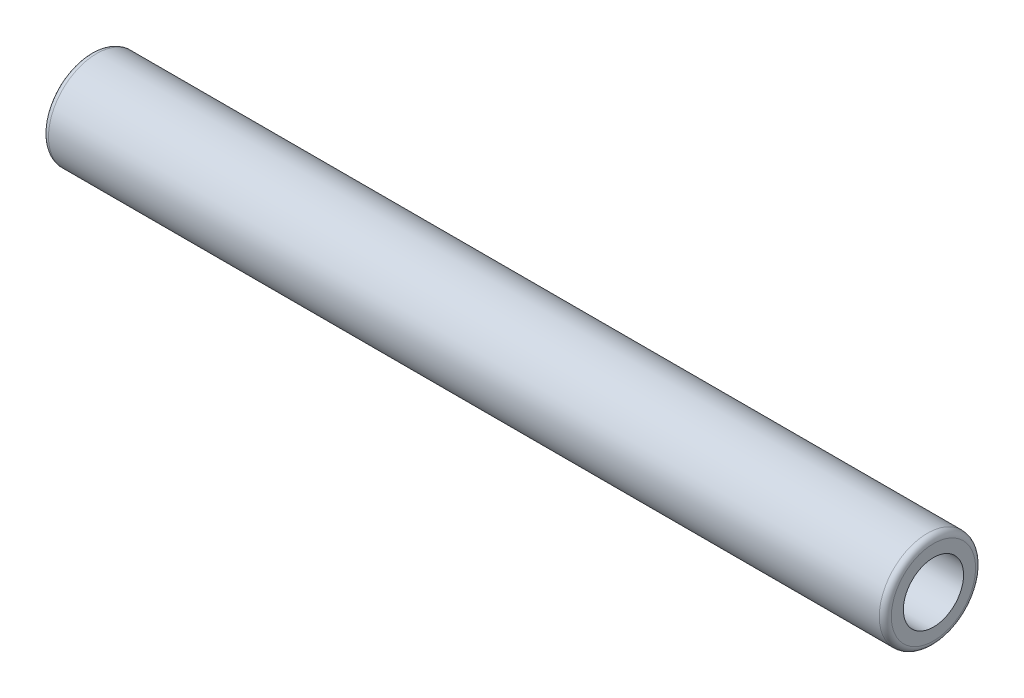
ISO-10303-21;
HEADER;
FILE_DESCRIPTION(('STEP AP214'),'2;1');
FILE_NAME('part.step','',(''),(''),'','','');
FILE_SCHEMA(('AUTOMOTIVE_DESIGN { 1 0 10303 214 1 1 1 1 }'));
ENDSEC;
DATA;
#1=APPLICATION_CONTEXT('core data for automotive mechanical design processes');
#2=APPLICATION_PROTOCOL_DEFINITION('international standard','automotive_design',2000,#1);
#3=PRODUCT_CONTEXT('',#1,'mechanical');
#4=PRODUCT('Part','Part','',(#3));
#5=PRODUCT_RELATED_PRODUCT_CATEGORY('part','',(#4));
#6=PRODUCT_DEFINITION_FORMATION('','',#4);
#7=PRODUCT_DEFINITION_CONTEXT('part definition',#1,'design');
#8=PRODUCT_DEFINITION('design','',#6,#7);
#9=PRODUCT_DEFINITION_SHAPE('','',#8);
#10=(LENGTH_UNIT() NAMED_UNIT(*) SI_UNIT(.MILLI.,.METRE.));
#11=(NAMED_UNIT(*) PLANE_ANGLE_UNIT() SI_UNIT($,.RADIAN.));
#12=(NAMED_UNIT(*) SI_UNIT($,.STERADIAN.) SOLID_ANGLE_UNIT());
#13=UNCERTAINTY_MEASURE_WITH_UNIT(LENGTH_MEASURE(1.E-05),#10,'distance_accuracy_value','');
#14=(GEOMETRIC_REPRESENTATION_CONTEXT(3) GLOBAL_UNCERTAINTY_ASSIGNED_CONTEXT((#13)) GLOBAL_UNIT_ASSIGNED_CONTEXT((#10,
#11,#12)) REPRESENTATION_CONTEXT('',''));
#15=CARTESIAN_POINT('',(0.,0.,0.));
#16=DIRECTION('',(0.,0.,1.));
#17=DIRECTION('',(1.,0.,0.));
#18=AXIS2_PLACEMENT_3D('',#15,#16,#17);
#19=CARTESIAN_POINT('',(0.,0.,0.));
#20=DIRECTION('',(1.,0.,0.));
#21=DIRECTION('',(0.,0.,-1.));
#22=AXIS2_PLACEMENT_3D('',#19,#20,#21);
#23=PLANE('',#22);
#24=CARTESIAN_POINT('',(0.,0.,0.));
#25=DIRECTION('',(1.,0.,0.));
#26=DIRECTION('',(0.,0.,-1.));
#27=AXIS2_PLACEMENT_3D('',#24,#25,#26);
#28=CIRCLE('',#27,3.5);
#29=CARTESIAN_POINT('',(0.,0.,-3.5));
#30=VERTEX_POINT('',#29);
#31=EDGE_CURVE('E29',#30,#30,#28,.F.);
#32=ORIENTED_EDGE('',*,*,#31,.T.);
#33=EDGE_LOOP('',(#32));
#34=FACE_BOUND('',#33,.T.);
#35=ADVANCED_FACE('F14',(#34),#23,.F.);
#36=CARTESIAN_POINT('',(0.,0.,0.));
#37=DIRECTION('',(-1.,0.,0.));
#38=DIRECTION('',(0.,0.,1.));
#39=AXIS2_PLACEMENT_3D('',#36,#37,#38);
#40=CYLINDRICAL_SURFACE('',#39,4.);
#41=CARTESIAN_POINT('',(0.5,0.,0.));
#42=DIRECTION('',(1.,0.,0.));
#43=DIRECTION('',(0.,0.,-1.));
#44=AXIS2_PLACEMENT_3D('',#41,#42,#43);
#45=CIRCLE('',#44,4.);
#46=CARTESIAN_POINT('',(0.5,0.,-4.));
#47=VERTEX_POINT('',#46);
#48=EDGE_CURVE('E21',#47,#47,#45,.T.);
#49=ORIENTED_EDGE('',*,*,#48,.T.);
#50=EDGE_LOOP('',(#49));
#51=FACE_BOUND('',#50,.T.);
#52=CARTESIAN_POINT('',(69.5,0.,0.));
#53=DIRECTION('',(-1.,0.,0.));
#54=DIRECTION('',(0.,0.,1.));
#55=AXIS2_PLACEMENT_3D('',#52,#53,#54);
#56=CIRCLE('',#55,4.);
#57=CARTESIAN_POINT('',(69.5,0.,4.));
#58=VERTEX_POINT('',#57);
#59=EDGE_CURVE('E25',#58,#58,#56,.T.);
#60=ORIENTED_EDGE('',*,*,#59,.T.);
#61=EDGE_LOOP('',(#60));
#62=FACE_BOUND('',#61,.T.);
#63=ADVANCED_FACE('F70',(#51,#62),#40,.T.);
#64=CARTESIAN_POINT('',(70.,4.,0.));
#65=DIRECTION('',(-1.,0.,0.));
#66=DIRECTION('',(0.,0.,1.));
#67=AXIS2_PLACEMENT_3D('',#64,#65,#66);
#68=PLANE('',#67);
#69=CARTESIAN_POINT('',(70.,0.,0.));
#70=DIRECTION('',(1.,0.,0.));
#71=DIRECTION('',(0.,0.,-1.));
#72=AXIS2_PLACEMENT_3D('',#69,#70,#71);
#73=CIRCLE('',#72,2.5);
#74=CARTESIAN_POINT('',(70.,0.,-2.5));
#75=VERTEX_POINT('',#74);
#76=EDGE_CURVE('E35',#75,#75,#73,.T.);
#77=ORIENTED_EDGE('',*,*,#76,.F.);
#78=EDGE_LOOP('',(#77));
#79=FACE_BOUND('',#78,.T.);
#80=CARTESIAN_POINT('',(70.,0.,0.));
#81=DIRECTION('',(-1.,0.,0.));
#82=DIRECTION('',(0.,0.,1.));
#83=AXIS2_PLACEMENT_3D('',#80,#81,#82);
#84=CIRCLE('',#83,3.5);
#85=CARTESIAN_POINT('',(70.,0.,3.5));
#86=VERTEX_POINT('',#85);
#87=EDGE_CURVE('E9',#86,#86,#84,.F.);
#88=ORIENTED_EDGE('',*,*,#87,.T.);
#89=EDGE_LOOP('',(#88));
#90=FACE_BOUND('',#89,.T.);
#91=ADVANCED_FACE('F67',(#79,#90),#68,.F.);
#92=CARTESIAN_POINT('',(0.5,0.,0.));
#93=DIRECTION('',(1.,0.,0.));
#94=DIRECTION('',(0.,0.,-1.));
#95=AXIS2_PLACEMENT_3D('',#92,#93,#94);
#96=TOROIDAL_SURFACE('',#95,3.5,0.5);
#97=ORIENTED_EDGE('',*,*,#48,.F.);
#98=EDGE_LOOP('',(#97));
#99=FACE_BOUND('',#98,.T.);
#100=ORIENTED_EDGE('',*,*,#31,.F.);
#101=EDGE_LOOP('',(#100));
#102=FACE_BOUND('',#101,.T.);
#103=ADVANCED_FACE('F69',(#99,#102),#96,.T.);
#104=CARTESIAN_POINT('',(69.5,0.,0.));
#105=DIRECTION('',(-1.,0.,0.));
#106=DIRECTION('',(0.,0.,1.));
#107=AXIS2_PLACEMENT_3D('',#104,#105,#106);
#108=TOROIDAL_SURFACE('',#107,3.5,0.5);
#109=ORIENTED_EDGE('',*,*,#87,.F.);
#110=EDGE_LOOP('',(#109));
#111=FACE_BOUND('',#110,.T.);
#112=ORIENTED_EDGE('',*,*,#59,.F.);
#113=EDGE_LOOP('',(#112));
#114=FACE_BOUND('',#113,.T.);
#115=ADVANCED_FACE('F16',(#111,#114),#108,.T.);
#116=CARTESIAN_POINT('',(62.,0.,0.));
#117=DIRECTION('',(1.,0.,0.));
#118=DIRECTION('',(0.,0.,-1.));
#119=AXIS2_PLACEMENT_3D('',#116,#117,#118);
#120=CYLINDRICAL_SURFACE('',#119,2.5);
#121=CARTESIAN_POINT('',(62.,0.,0.));
#122=DIRECTION('',(1.,0.,0.));
#123=DIRECTION('',(0.,0.,-1.));
#124=AXIS2_PLACEMENT_3D('',#121,#122,#123);
#125=CIRCLE('',#124,2.5);
#126=CARTESIAN_POINT('',(62.,0.,-2.5));
#127=VERTEX_POINT('',#126);
#128=EDGE_CURVE('E34',#127,#127,#125,.T.);
#129=ORIENTED_EDGE('',*,*,#128,.F.);
#130=EDGE_LOOP('',(#129));
#131=FACE_BOUND('',#130,.T.);
#132=ORIENTED_EDGE('',*,*,#76,.T.);
#133=EDGE_LOOP('',(#132));
#134=FACE_BOUND('',#133,.T.);
#135=ADVANCED_FACE('F58',(#131,#134),#120,.F.);
#136=CARTESIAN_POINT('',(62.,0.,0.));
#137=DIRECTION('',(1.,0.,0.));
#138=DIRECTION('',(0.,0.,-1.));
#139=AXIS2_PLACEMENT_3D('',#136,#137,#138);
#140=PLANE('',#139);
#141=CARTESIAN_POINT('',(62.,0.,0.));
#142=DIRECTION('',(1.,0.,0.));
#143=DIRECTION('',(0.,0.,-1.));
#144=AXIS2_PLACEMENT_3D('',#141,#142,#143);
#145=CIRCLE('',#144,1.65);
#146=CARTESIAN_POINT('',(62.,0.,-1.65));
#147=VERTEX_POINT('',#146);
#148=EDGE_CURVE('E41',#147,#147,#145,.T.);
#149=ORIENTED_EDGE('',*,*,#148,.F.);
#150=EDGE_LOOP('',(#149));
#151=FACE_BOUND('',#150,.T.);
#152=ORIENTED_EDGE('',*,*,#128,.T.);
#153=EDGE_LOOP('',(#152));
#154=FACE_BOUND('',#153,.T.);
#155=ADVANCED_FACE('F52',(#151,#154),#140,.T.);
#156=CARTESIAN_POINT('',(58.,0.,0.));
#157=DIRECTION('',(1.,0.,0.));
#158=DIRECTION('',(0.,0.,-1.));
#159=AXIS2_PLACEMENT_3D('',#156,#157,#158);
#160=CYLINDRICAL_SURFACE('',#159,1.65);
#161=CARTESIAN_POINT('',(58.,0.,0.));
#162=DIRECTION('',(1.,0.,0.));
#163=DIRECTION('',(0.,0.,-1.));
#164=AXIS2_PLACEMENT_3D('',#161,#162,#163);
#165=CIRCLE('',#164,1.65);
#166=CARTESIAN_POINT('',(58.,0.,-1.65));
#167=VERTEX_POINT('',#166);
#168=EDGE_CURVE('E38',#167,#167,#165,.T.);
#169=ORIENTED_EDGE('',*,*,#168,.F.);
#170=EDGE_LOOP('',(#169));
#171=FACE_BOUND('',#170,.T.);
#172=ORIENTED_EDGE('',*,*,#148,.T.);
#173=EDGE_LOOP('',(#172));
#174=FACE_BOUND('',#173,.T.);
#175=ADVANCED_FACE('F49',(#171,#174),#160,.F.);
#176=CARTESIAN_POINT('',(58.,0.,0.));
#177=DIRECTION('',(1.,0.,0.));
#178=DIRECTION('',(0.,0.,-1.));
#179=AXIS2_PLACEMENT_3D('',#176,#177,#178);
#180=PLANE('',#179);
#181=ORIENTED_EDGE('',*,*,#168,.T.);
#182=EDGE_LOOP('',(#181));
#183=FACE_BOUND('',#182,.T.);
#184=ADVANCED_FACE('F47',(#183),#180,.T.);
#185=CLOSED_SHELL('',(#35,#63,#91,#103,#115,#135,#155,#175,#184));
#186=MANIFOLD_SOLID_BREP('B1',#185);
#187=ADVANCED_BREP_SHAPE_REPRESENTATION('',(#18,#186),#14);
#188=SHAPE_DEFINITION_REPRESENTATION(#9,#187);
ENDSEC;
END-ISO-10303-21;
